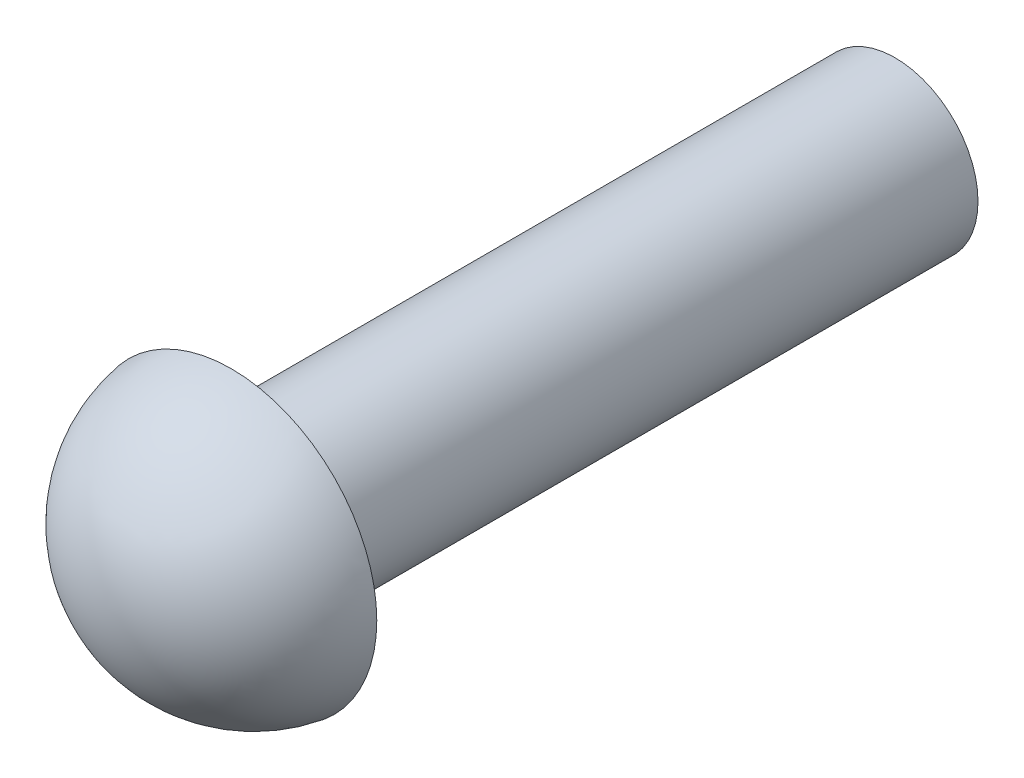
from build123d import *


with BuildPart() as part:
    # BaseBodySke → BaseBody (revolve)
    with BuildSketch(Plane(origin=(0, 0, 0), x_dir=(1, 0, 0), z_dir=(0, 1, 0))):
        with BuildLine():
            Line((-5.5626, 4.7752), (-3.175, 4.7752))
            Line((-3.175, 4.7752), (-3.175, 30.1752))
            Line((-3.175, 30.1752), (0, 30.1752))
            Line((0, 30.1752), (0, 0))
            ThreePointArc((0, 0), (-3.665550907, 1.357541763), (-5.5626, 4.7752))
        make_face()
    revolve(axis=Axis((0, 0, 0), (0, 0, -1)))


solid = part.part
